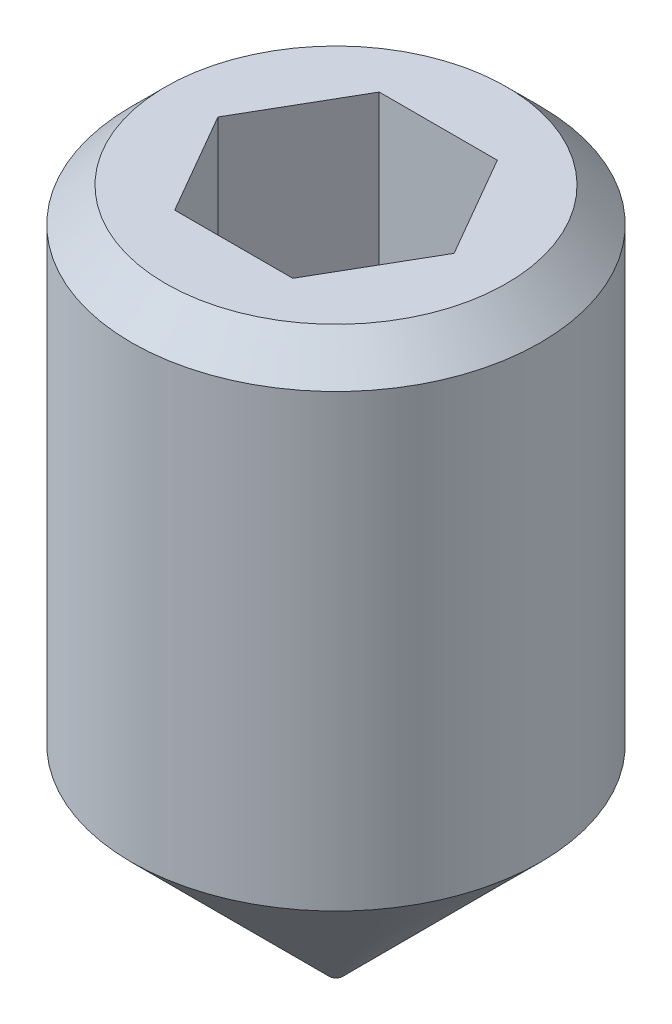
from build123d import *

# Parameters (mm, degrees)
ESQUISSE1_R             = 1.5
LONGUEUR_FILT_DEPTH     = 5
CHANFREIN1_SIZE         = 0.25
ENL_V_MAT_EXTRU_4_DEPTH = 2


with BuildPart() as part:
    # Esquisse1 → Longueur filt (new body)
    with BuildSketch(Plane(origin=(0, 0, 0), x_dir=(1, 0, 0), z_dir=(0, 1, 0))):
        with Locations(Location((0, 0, 0), (0, 0, 270))):
            Circle(ESQUISSE1_R)
    extrude(amount=LONGUEUR_FILT_DEPTH)

    # Chanfrein1
    chanfrein1_edges = [part.edges().sort_by_distance(p)[0] for p in [
        (0, 5, -1.5),
    ]]
    chamfer(chanfrein1_edges, length=CHANFREIN1_SIZE)

    # Esquisse6 → Enl_v. mat.-Extru.4 (cut)
    with BuildSketch(Plane(origin=(0, 5, 0), x_dir=(-1, 0, 0), z_dir=(0, -1, 0))):
        Polygon((0.866025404, 0), (0.433012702, 0.75), (-0.433012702, 0.75), (-0.866025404, 0), (-0.433012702, -0.75), (0.433012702, -0.75), align=None)
    extrude(amount=ENL_V_MAT_EXTRU_4_DEPTH, mode=Mode.SUBTRACT)

    # Esquisse9 → Enl_vement de mati_re-R_volution2 (revolve, cut)
    with BuildSketch(Plane(origin=(0, 0, 0), x_dir=(0, 0, -1), z_dir=(1, 0, 0))):
        Polygon((-0.05, 0), (-1.5, 1.45), (-1.5, 0), align=None)
    revolve(axis=Axis((0, 0, 0), (0, 1, 0)), mode=Mode.SUBTRACT)


solid = part.part
